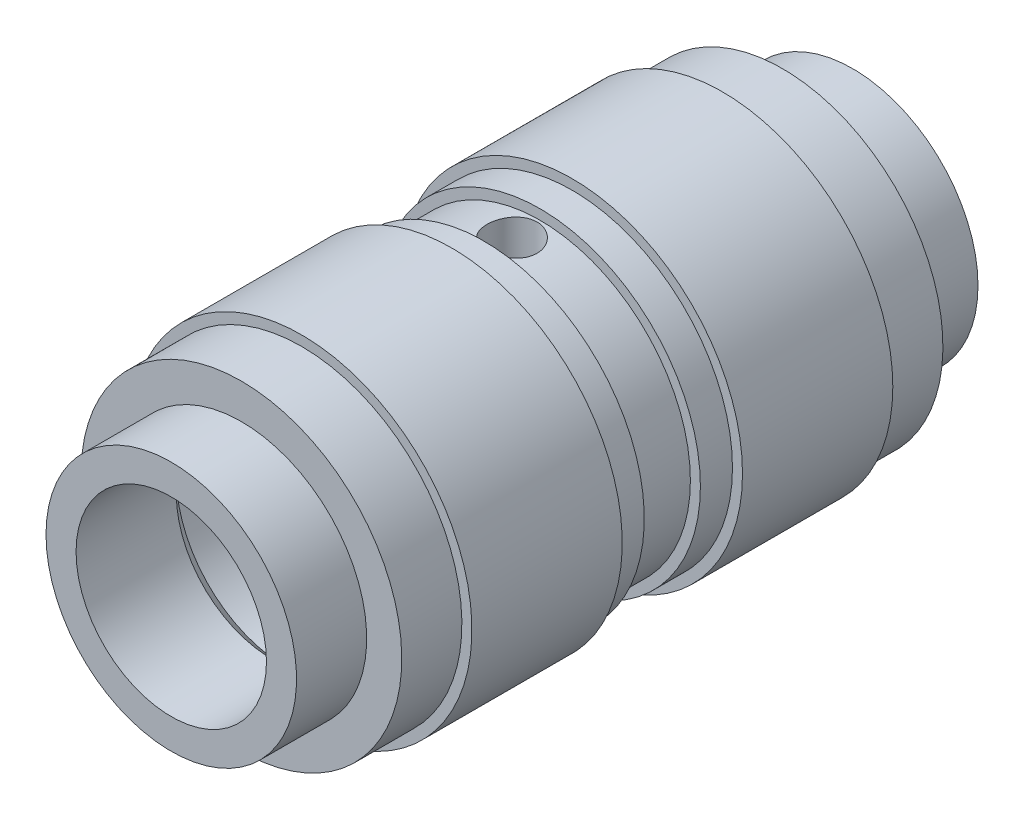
ISO-10303-21;
HEADER;
FILE_DESCRIPTION(('STEP AP214'),'2;1');
FILE_NAME('part.step','',(''),(''),'','','');
FILE_SCHEMA(('AUTOMOTIVE_DESIGN { 1 0 10303 214 1 1 1 1 }'));
ENDSEC;
DATA;
#1=APPLICATION_CONTEXT('core data for automotive mechanical design processes');
#2=APPLICATION_PROTOCOL_DEFINITION('international standard','automotive_design',2000,#1);
#3=PRODUCT_CONTEXT('',#1,'mechanical');
#4=PRODUCT('Part','Part','',(#3));
#5=PRODUCT_RELATED_PRODUCT_CATEGORY('part','',(#4));
#6=PRODUCT_DEFINITION_FORMATION('','',#4);
#7=PRODUCT_DEFINITION_CONTEXT('part definition',#1,'design');
#8=PRODUCT_DEFINITION('design','',#6,#7);
#9=PRODUCT_DEFINITION_SHAPE('','',#8);
#10=(LENGTH_UNIT() NAMED_UNIT(*) SI_UNIT(.MILLI.,.METRE.));
#11=(NAMED_UNIT(*) PLANE_ANGLE_UNIT() SI_UNIT($,.RADIAN.));
#12=(NAMED_UNIT(*) SI_UNIT($,.STERADIAN.) SOLID_ANGLE_UNIT());
#13=UNCERTAINTY_MEASURE_WITH_UNIT(LENGTH_MEASURE(1.E-05),#10,'distance_accuracy_value','');
#14=(GEOMETRIC_REPRESENTATION_CONTEXT(3) GLOBAL_UNCERTAINTY_ASSIGNED_CONTEXT((#13)) GLOBAL_UNIT_ASSIGNED_CONTEXT((#10,
#11,#12)) REPRESENTATION_CONTEXT('',''));
#15=CARTESIAN_POINT('',(0.,0.,0.));
#16=DIRECTION('',(0.,0.,1.));
#17=DIRECTION('',(1.,0.,0.));
#18=AXIS2_PLACEMENT_3D('',#15,#16,#17);
#19=CARTESIAN_POINT('',(0.,0.,-34.));
#20=DIRECTION('',(0.,0.,1.));
#21=DIRECTION('',(1.,0.,0.));
#22=AXIS2_PLACEMENT_3D('',#19,#20,#21);
#23=CYLINDRICAL_SURFACE('',#22,9.5);
#24=CARTESIAN_POINT('',(0.,0.,-34.));
#25=DIRECTION('',(0.,0.,1.));
#26=DIRECTION('',(1.,0.,0.));
#27=AXIS2_PLACEMENT_3D('',#24,#25,#26);
#28=CIRCLE('',#27,9.5);
#29=CARTESIAN_POINT('',(9.5,0.,-34.));
#30=VERTEX_POINT('',#29);
#31=EDGE_CURVE('E107',#30,#30,#28,.F.);
#32=ORIENTED_EDGE('',*,*,#31,.T.);
#33=EDGE_LOOP('',(#32));
#34=FACE_BOUND('',#33,.T.);
#35=CARTESIAN_POINT('',(0.,0.,-24.));
#36=DIRECTION('',(0.,0.,1.));
#37=DIRECTION('',(1.,0.,0.));
#38=AXIS2_PLACEMENT_3D('',#35,#36,#37);
#39=CIRCLE('',#38,9.5);
#40=CARTESIAN_POINT('',(9.5,0.,-24.));
#41=VERTEX_POINT('',#40);
#42=EDGE_CURVE('E48',#41,#41,#39,.F.);
#43=ORIENTED_EDGE('',*,*,#42,.F.);
#44=EDGE_LOOP('',(#43));
#45=FACE_BOUND('',#44,.T.);
#46=ADVANCED_FACE('F28',(#34,#45),#23,.F.);
#47=CARTESIAN_POINT('',(-12.65,-12.65,-34.));
#48=DIRECTION('',(0.,0.,1.));
#49=DIRECTION('',(1.,0.,0.));
#50=AXIS2_PLACEMENT_3D('',#47,#48,#49);
#51=PLANE('',#50);
#52=ORIENTED_EDGE('',*,*,#31,.F.);
#53=EDGE_LOOP('',(#52));
#54=FACE_BOUND('',#53,.T.);
#55=CARTESIAN_POINT('',(0.,0.,-34.));
#56=DIRECTION('',(0.,0.,1.));
#57=DIRECTION('',(1.,0.,0.));
#58=AXIS2_PLACEMENT_3D('',#55,#56,#57);
#59=CIRCLE('',#58,12.5);
#60=CARTESIAN_POINT('',(12.5,0.,-34.));
#61=VERTEX_POINT('',#60);
#62=EDGE_CURVE('E105',#61,#61,#59,.F.);
#63=ORIENTED_EDGE('',*,*,#62,.T.);
#64=EDGE_LOOP('',(#63));
#65=FACE_BOUND('',#64,.T.);
#66=ADVANCED_FACE('F135',(#54,#65),#51,.F.);
#67=CARTESIAN_POINT('',(0.,0.,-24.));
#68=DIRECTION('',(0.,0.,1.));
#69=DIRECTION('',(1.,0.,0.));
#70=AXIS2_PLACEMENT_3D('',#67,#68,#69);
#71=CONICAL_SURFACE('',#70,9.5,0.785398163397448);
#72=ORIENTED_EDGE('',*,*,#42,.T.);
#73=EDGE_LOOP('',(#72));
#74=FACE_BOUND('',#73,.T.);
#75=CARTESIAN_POINT('',(0.,0.,-22.5));
#76=DIRECTION('',(0.,0.,1.));
#77=DIRECTION('',(1.,0.,0.));
#78=AXIS2_PLACEMENT_3D('',#75,#76,#77);
#79=CIRCLE('',#78,11.);
#80=CARTESIAN_POINT('',(11.,0.,-22.5));
#81=VERTEX_POINT('',#80);
#82=EDGE_CURVE('E104',#81,#81,#79,.F.);
#83=ORIENTED_EDGE('',*,*,#82,.F.);
#84=EDGE_LOOP('',(#83));
#85=FACE_BOUND('',#84,.T.);
#86=ADVANCED_FACE('F136',(#74,#85),#71,.F.);
#87=CARTESIAN_POINT('',(0.,0.,-34.));
#88=DIRECTION('',(0.,0.,1.));
#89=DIRECTION('',(1.,0.,0.));
#90=AXIS2_PLACEMENT_3D('',#87,#88,#89);
#91=CYLINDRICAL_SURFACE('',#90,12.5);
#92=CARTESIAN_POINT('',(0.,0.,-27.));
#93=DIRECTION('',(0.,0.,1.));
#94=DIRECTION('',(1.,0.,0.));
#95=AXIS2_PLACEMENT_3D('',#92,#93,#94);
#96=CIRCLE('',#95,12.5);
#97=CARTESIAN_POINT('',(12.5,0.,-27.));
#98=VERTEX_POINT('',#97);
#99=EDGE_CURVE('E101',#98,#98,#96,.F.);
#100=ORIENTED_EDGE('',*,*,#99,.T.);
#101=EDGE_LOOP('',(#100));
#102=FACE_BOUND('',#101,.T.);
#103=ORIENTED_EDGE('',*,*,#62,.F.);
#104=EDGE_LOOP('',(#103));
#105=FACE_BOUND('',#104,.T.);
#106=ADVANCED_FACE('F139',(#102,#105),#91,.T.);
#107=CARTESIAN_POINT('',(0.,0.,-22.5));
#108=DIRECTION('',(0.,0.,1.));
#109=DIRECTION('',(1.,0.,0.));
#110=AXIS2_PLACEMENT_3D('',#107,#108,#109);
#111=CYLINDRICAL_SURFACE('',#110,11.);
#112=ORIENTED_EDGE('',*,*,#82,.T.);
#113=EDGE_LOOP('',(#112));
#114=FACE_BOUND('',#113,.T.);
#115=CARTESIAN_POINT('',(0.,0.,-5.50000000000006));
#116=DIRECTION('',(0.,0.,-1.));
#117=DIRECTION('',(-1.,0.,0.));
#118=AXIS2_PLACEMENT_3D('',#115,#116,#117);
#119=CIRCLE('',#118,11.);
#120=CARTESIAN_POINT('',(-11.,0.,-5.5));
#121=VERTEX_POINT('',#120);
#122=EDGE_CURVE('E100',#121,#121,#119,.T.);
#123=ORIENTED_EDGE('',*,*,#122,.F.);
#124=EDGE_LOOP('',(#123));
#125=FACE_BOUND('',#124,.T.);
#126=ADVANCED_FACE('F143',(#114,#125),#111,.F.);
#127=CARTESIAN_POINT('',(-16.192,-16.192,-27.));
#128=DIRECTION('',(0.,0.,1.));
#129=DIRECTION('',(1.,0.,0.));
#130=AXIS2_PLACEMENT_3D('',#127,#128,#129);
#131=PLANE('',#130);
#132=ORIENTED_EDGE('',*,*,#99,.F.);
#133=EDGE_LOOP('',(#132));
#134=FACE_BOUND('',#133,.T.);
#135=CARTESIAN_POINT('',(0.,0.,-27.));
#136=DIRECTION('',(0.,0.,1.));
#137=DIRECTION('',(0.,-1.,0.));
#138=AXIS2_PLACEMENT_3D('',#135,#136,#137);
#139=CIRCLE('',#138,16.);
#140=CARTESIAN_POINT('',(0.,-16.,-27.));
#141=VERTEX_POINT('',#140);
#142=EDGE_CURVE('E97',#141,#141,#139,.F.);
#143=ORIENTED_EDGE('',*,*,#142,.T.);
#144=EDGE_LOOP('',(#143));
#145=FACE_BOUND('',#144,.T.);
#146=ADVANCED_FACE('F147',(#134,#145),#131,.F.);
#147=CARTESIAN_POINT('',(0.,0.,-4.));
#148=DIRECTION('',(0.,0.,-1.));
#149=DIRECTION('',(-1.,0.,0.));
#150=AXIS2_PLACEMENT_3D('',#147,#148,#149);
#151=CONICAL_SURFACE('',#150,9.5,0.785398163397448);
#152=CARTESIAN_POINT('',(0.,0.,-4.));
#153=DIRECTION('',(0.,0.,1.));
#154=DIRECTION('',(1.,0.,0.));
#155=AXIS2_PLACEMENT_3D('',#152,#153,#154);
#156=CIRCLE('',#155,9.5);
#157=CARTESIAN_POINT('',(9.5,0.,-4.));
#158=VERTEX_POINT('',#157);
#159=EDGE_CURVE('E96',#158,#158,#156,.F.);
#160=ORIENTED_EDGE('',*,*,#159,.F.);
#161=EDGE_LOOP('',(#160));
#162=FACE_BOUND('',#161,.T.);
#163=ORIENTED_EDGE('',*,*,#122,.T.);
#164=EDGE_LOOP('',(#163));
#165=FACE_BOUND('',#164,.T.);
#166=ADVANCED_FACE('F149',(#162,#165),#151,.F.);
#167=CARTESIAN_POINT('',(0.,0.,-27.));
#168=DIRECTION('',(0.,0.,1.));
#169=DIRECTION('',(0.,-1.,0.));
#170=AXIS2_PLACEMENT_3D('',#167,#168,#169);
#171=CYLINDRICAL_SURFACE('',#170,16.);
#172=CARTESIAN_POINT('',(0.,0.,-21.));
#173=DIRECTION('',(0.,0.,1.));
#174=DIRECTION('',(0.,-1.,0.));
#175=AXIS2_PLACEMENT_3D('',#172,#173,#174);
#176=CIRCLE('',#175,16.);
#177=CARTESIAN_POINT('',(0.,-16.,-21.));
#178=VERTEX_POINT('',#177);
#179=EDGE_CURVE('E93',#178,#178,#176,.F.);
#180=ORIENTED_EDGE('',*,*,#179,.T.);
#181=EDGE_LOOP('',(#180));
#182=FACE_BOUND('',#181,.T.);
#183=ORIENTED_EDGE('',*,*,#142,.F.);
#184=EDGE_LOOP('',(#183));
#185=FACE_BOUND('',#184,.T.);
#186=ADVANCED_FACE('F151',(#182,#185),#171,.T.);
#187=CARTESIAN_POINT('',(0.,0.,-4.));
#188=DIRECTION('',(0.,0.,1.));
#189=DIRECTION('',(1.,0.,0.));
#190=AXIS2_PLACEMENT_3D('',#187,#188,#189);
#191=CYLINDRICAL_SURFACE('',#190,9.5);
#192=CARTESIAN_POINT('',(0.,9.5,-2.5));
#193=CARTESIAN_POINT('',(0.137884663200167,9.4999978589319,-2.49999659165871));
#194=CARTESIAN_POINT('',(0.275806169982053,9.49696845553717,-2.48855441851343));
#195=CARTESIAN_POINT('',(0.54768042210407,9.48517762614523,-2.44316636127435));
#196=CARTESIAN_POINT('',(0.681631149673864,9.47641333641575,-2.40920923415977));
#197=CARTESIAN_POINT('',(0.941599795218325,9.45412076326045,-2.31996842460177));
#198=CARTESIAN_POINT('',(1.06762755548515,9.44059853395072,-2.26471183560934));
#199=CARTESIAN_POINT('',(1.30862652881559,9.41022151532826,-2.13453997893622));
#200=CARTESIAN_POINT('',(1.42359708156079,9.39336652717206,-2.05962353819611));
#201=CARTESIAN_POINT('',(1.64181993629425,9.35771941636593,-1.89046838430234));
#202=CARTESIAN_POINT('',(1.74478634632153,9.33889486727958,-1.79586767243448));
#203=CARTESIAN_POINT('',(1.93359084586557,9.30164002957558,-1.59080344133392));
#204=CARTESIAN_POINT('',(2.01942679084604,9.28320979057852,-1.48033793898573));
#205=CARTESIAN_POINT('',(2.17291708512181,9.24849966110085,-1.24441123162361));
#206=CARTESIAN_POINT('',(2.24024449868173,9.23226073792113,-1.11873074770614));
#207=CARTESIAN_POINT('',(2.35270147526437,9.20424780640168,-0.857337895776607));
#208=CARTESIAN_POINT('',(2.39783501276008,9.19247299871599,-0.721627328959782));
#209=CARTESIAN_POINT('',(2.46363395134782,9.17505594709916,-0.447188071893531));
#210=CARTESIAN_POINT('',(2.48481677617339,9.16928424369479,-0.308591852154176));
#211=CARTESIAN_POINT('',(2.50372582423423,9.16413995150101,-0.0297019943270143));
#212=CARTESIAN_POINT('',(2.50145630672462,9.16476620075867,0.110591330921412));
#213=CARTESIAN_POINT('',(2.47393631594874,9.1722310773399,0.384870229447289));
#214=CARTESIAN_POINT('',(2.44930986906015,9.1789010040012,0.518923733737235));
#215=CARTESIAN_POINT('',(2.37877367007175,9.19743185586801,0.780926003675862));
#216=CARTESIAN_POINT('',(2.33286225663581,9.2092931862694,0.908874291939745));
#217=CARTESIAN_POINT('',(2.22054589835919,9.23702010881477,1.15667078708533));
#218=CARTESIAN_POINT('',(2.15392053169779,9.25292841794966,1.27641410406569));
#219=CARTESIAN_POINT('',(2.0022213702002,9.28693362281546,1.50324135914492));
#220=CARTESIAN_POINT('',(1.91714402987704,9.30503093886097,1.61032285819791));
#221=CARTESIAN_POINT('',(1.72775627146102,9.3420790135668,1.81235449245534));
#222=CARTESIAN_POINT('',(1.62292126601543,9.36103863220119,1.90681192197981));
#223=CARTESIAN_POINT('',(1.39866809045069,9.39715951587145,2.07690465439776));
#224=CARTESIAN_POINT('',(1.27924937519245,9.41432071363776,2.15253925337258));
#225=CARTESIAN_POINT('',(1.02846858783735,9.44501219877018,2.28304842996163));
#226=CARTESIAN_POINT('',(0.897059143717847,9.45852716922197,2.33783581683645));
#227=CARTESIAN_POINT('',(0.626458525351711,9.48029259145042,2.42440041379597));
#228=CARTESIAN_POINT('',(0.487269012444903,9.48854416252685,2.45618251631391));
#229=CARTESIAN_POINT('',(0.209265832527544,9.49868456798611,2.49506532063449));
#230=CARTESIAN_POINT('',(0.0705520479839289,9.50074610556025,2.50283612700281));
#231=CARTESIAN_POINT('',(-0.206196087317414,9.49876969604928,2.49532360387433));
#232=CARTESIAN_POINT('',(-0.344230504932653,9.49473236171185,2.48004259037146));
#233=CARTESIAN_POINT('',(-0.613323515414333,9.48112321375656,2.42741045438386));
#234=CARTESIAN_POINT('',(-0.744460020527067,9.47164474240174,2.39043132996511));
#235=CARTESIAN_POINT('',(-0.998656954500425,9.44822690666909,2.29588312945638));
#236=CARTESIAN_POINT('',(-1.12171651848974,9.43428706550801,2.23831185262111));
#237=CARTESIAN_POINT('',(-1.35888360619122,9.40308612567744,2.10295867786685));
#238=CARTESIAN_POINT('',(-1.47277384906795,9.38576639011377,2.02480991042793));
#239=CARTESIAN_POINT('',(-1.68605972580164,9.34980860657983,1.85098296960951));
#240=CARTESIAN_POINT('',(-1.78545256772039,9.33117030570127,1.75530142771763));
#241=CARTESIAN_POINT('',(-1.96973268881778,9.29404354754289,1.54600098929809));
#242=CARTESIAN_POINT('',(-2.05414772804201,9.27557319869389,1.43196233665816));
#243=CARTESIAN_POINT('',(-2.20265077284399,9.24143699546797,1.19094950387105));
#244=CARTESIAN_POINT('',(-2.26673964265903,9.22577102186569,1.06397587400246));
#245=CARTESIAN_POINT('',(-2.37228864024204,9.1991961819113,0.801343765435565));
#246=CARTESIAN_POINT('',(-2.41388084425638,9.18825962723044,0.665741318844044));
#247=CARTESIAN_POINT('',(-2.47357685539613,9.17237100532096,0.389131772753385));
#248=CARTESIAN_POINT('',(-2.49168647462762,9.16741745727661,0.248126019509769));
#249=CARTESIAN_POINT('',(-2.5035754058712,9.16417710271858,-0.0304591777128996));
#250=CARTESIAN_POINT('',(-2.49811278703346,9.16568256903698,-0.16800434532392));
#251=CARTESIAN_POINT('',(-2.46476570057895,9.17470557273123,-0.440138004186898));
#252=CARTESIAN_POINT('',(-2.43688178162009,9.18222296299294,-0.574726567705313));
#253=CARTESIAN_POINT('',(-2.35991776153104,9.20230081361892,-0.83620045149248));
#254=CARTESIAN_POINT('',(-2.31099432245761,9.214823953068,-0.963134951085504));
#255=CARTESIAN_POINT('',(-2.19346205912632,9.24350405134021,-1.20708916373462));
#256=CARTESIAN_POINT('',(-2.12485022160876,9.25966156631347,-1.32410735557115));
#257=CARTESIAN_POINT('',(-1.96757430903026,9.29436941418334,-1.54853541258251));
#258=CARTESIAN_POINT('',(-1.87839103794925,9.31297513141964,-1.6555729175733));
#259=CARTESIAN_POINT('',(-1.68349652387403,9.35016921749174,-1.85340941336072));
#260=CARTESIAN_POINT('',(-1.57778128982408,9.36875758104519,-1.94420447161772));
#261=CARTESIAN_POINT('',(-1.35018708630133,9.40428175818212,-2.10882024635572));
#262=CARTESIAN_POINT('',(-1.22801920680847,9.42117547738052,-2.18225135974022));
#263=CARTESIAN_POINT('',(-0.972633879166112,9.45095016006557,-2.30741745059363));
#264=CARTESIAN_POINT('',(-0.839423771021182,9.46383376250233,-2.35916670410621));
#265=CARTESIAN_POINT('',(-0.588875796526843,9.48241870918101,-2.43254809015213));
#266=CARTESIAN_POINT('',(-0.472643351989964,9.4889642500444,-2.4577847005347));
#267=CARTESIAN_POINT('',(-0.237616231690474,9.49775561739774,-2.49151134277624));
#268=CARTESIAN_POINT('',(-0.118821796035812,9.50000184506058,-2.50000293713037));
#269=CARTESIAN_POINT('',(0.,9.5,-2.5));
#270=B_SPLINE_CURVE_WITH_KNOTS('',3,(#192,#193,#194,#195,#196,#197,#198,#199,#200,#201,#202,
#203,#204,#205,#206,#207,#208,#209,#210,#211,#212,#213,#214,#215,#216,#217,#218,#219,#220,#221,
#222,#223,#224,#225,#226,#227,#228,#229,#230,#231,#232,#233,#234,#235,#236,#237,#238,#239,#240,
#241,#242,#243,#244,#245,#246,#247,#248,#249,#250,#251,#252,#253,#254,#255,#256,#257,#258,#259,
#260,#261,#262,#263,#264,#265,#266,#267,#268,#269),.UNSPECIFIED.,.T.,.F.,(4,2,2,2,2,2,2,2,2,2,2,
2,2,2,2,2,2,2,2,2,2,2,2,2,2,2,2,2,2,2,2,2,2,2,2,2,2,2,4),(0.,0.413218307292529,
0.826643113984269,1.23954376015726,1.65246904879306,2.07379267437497,2.49516901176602,
2.92356960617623,3.35189345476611,3.77077570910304,4.18958189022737,4.59704611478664,
5.00454214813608,5.41653210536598,5.82860129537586,6.2537447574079,6.67890411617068,
7.10582259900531,7.53265026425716,7.94745325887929,8.36221458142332,8.7700647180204,
9.177958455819,9.59368485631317,10.0094912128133,10.4366941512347,10.8638789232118,
11.2885277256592,11.7130714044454,12.1240655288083,12.5350495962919,12.9430250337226,
13.3510629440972,13.7708169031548,14.1906723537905,14.6192052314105,15.0474555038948,
15.4035786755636,15.7596686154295),.UNSPECIFIED.);
#271=CARTESIAN_POINT('',(0.,9.5,-2.5));
#272=VERTEX_POINT('',#271);
#273=EDGE_CURVE('E109',#272,#272,#270,.T.);
#274=ORIENTED_EDGE('',*,*,#273,.F.);
#275=EDGE_LOOP('',(#274));
#276=FACE_BOUND('',#275,.T.);
#277=ORIENTED_EDGE('',*,*,#159,.T.);
#278=EDGE_LOOP('',(#277));
#279=FACE_BOUND('',#278,.T.);
#280=CARTESIAN_POINT('',(0.,0.,4.));
#281=DIRECTION('',(0.,0.,1.));
#282=DIRECTION('',(-1.,0.,0.));
#283=AXIS2_PLACEMENT_3D('',#280,#281,#282);
#284=CIRCLE('',#283,9.5);
#285=CARTESIAN_POINT('',(-9.5,0.,4.));
#286=VERTEX_POINT('',#285);
#287=EDGE_CURVE('E92',#286,#286,#284,.F.);
#288=ORIENTED_EDGE('',*,*,#287,.F.);
#289=EDGE_LOOP('',(#288));
#290=FACE_BOUND('',#289,.T.);
#291=ADVANCED_FACE('F123',(#276,#279,#290),#191,.F.);
#292=CARTESIAN_POINT('',(-17.204,-17.204,-21.));
#293=DIRECTION('',(0.,0.,1.));
#294=DIRECTION('',(1.,0.,0.));
#295=AXIS2_PLACEMENT_3D('',#292,#293,#294);
#296=PLANE('',#295);
#297=ORIENTED_EDGE('',*,*,#179,.F.);
#298=EDGE_LOOP('',(#297));
#299=FACE_BOUND('',#298,.T.);
#300=CARTESIAN_POINT('',(0.,0.,-21.));
#301=DIRECTION('',(0.,0.,1.));
#302=DIRECTION('',(1.,0.,0.));
#303=AXIS2_PLACEMENT_3D('',#300,#301,#302);
#304=CIRCLE('',#303,17.);
#305=CARTESIAN_POINT('',(17.,0.,-21.));
#306=VERTEX_POINT('',#305);
#307=EDGE_CURVE('E89',#306,#306,#304,.F.);
#308=ORIENTED_EDGE('',*,*,#307,.T.);
#309=EDGE_LOOP('',(#308));
#310=FACE_BOUND('',#309,.T.);
#311=ADVANCED_FACE('F158',(#299,#310),#296,.F.);
#312=CARTESIAN_POINT('',(0.,0.,4.));
#313=DIRECTION('',(0.,0.,1.));
#314=DIRECTION('',(1.,0.,0.));
#315=AXIS2_PLACEMENT_3D('',#312,#313,#314);
#316=CONICAL_SURFACE('',#315,9.5,0.785398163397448);
#317=CARTESIAN_POINT('',(0.,0.,5.5));
#318=DIRECTION('',(0.,0.,-1.));
#319=DIRECTION('',(1.,0.,0.));
#320=AXIS2_PLACEMENT_3D('',#317,#318,#319);
#321=CIRCLE('',#320,11.);
#322=CARTESIAN_POINT('',(11.,0.,5.5));
#323=VERTEX_POINT('',#322);
#324=EDGE_CURVE('E88',#323,#323,#321,.T.);
#325=ORIENTED_EDGE('',*,*,#324,.F.);
#326=EDGE_LOOP('',(#325));
#327=FACE_BOUND('',#326,.T.);
#328=ORIENTED_EDGE('',*,*,#287,.T.);
#329=EDGE_LOOP('',(#328));
#330=FACE_BOUND('',#329,.T.);
#331=ADVANCED_FACE('F183',(#327,#330),#316,.F.);
#332=CARTESIAN_POINT('',(0.,0.,-21.));
#333=DIRECTION('',(0.,0.,1.));
#334=DIRECTION('',(1.,0.,0.));
#335=AXIS2_PLACEMENT_3D('',#332,#333,#334);
#336=CYLINDRICAL_SURFACE('',#335,17.);
#337=CARTESIAN_POINT('',(0.,0.,-6.));
#338=DIRECTION('',(0.,0.,1.));
#339=DIRECTION('',(1.,0.,0.));
#340=AXIS2_PLACEMENT_3D('',#337,#338,#339);
#341=CIRCLE('',#340,17.);
#342=CARTESIAN_POINT('',(17.,0.,-6.));
#343=VERTEX_POINT('',#342);
#344=EDGE_CURVE('E85',#343,#343,#341,.F.);
#345=ORIENTED_EDGE('',*,*,#344,.T.);
#346=EDGE_LOOP('',(#345));
#347=FACE_BOUND('',#346,.T.);
#348=ORIENTED_EDGE('',*,*,#307,.F.);
#349=EDGE_LOOP('',(#348));
#350=FACE_BOUND('',#349,.T.);
#351=ADVANCED_FACE('F244',(#347,#350),#336,.T.);
#352=CARTESIAN_POINT('',(0.,0.,22.5));
#353=DIRECTION('',(0.,0.,-1.));
#354=DIRECTION('',(-1.,0.,0.));
#355=AXIS2_PLACEMENT_3D('',#352,#353,#354);
#356=CYLINDRICAL_SURFACE('',#355,11.);
#357=ORIENTED_EDGE('',*,*,#324,.T.);
#358=EDGE_LOOP('',(#357));
#359=FACE_BOUND('',#358,.T.);
#360=CARTESIAN_POINT('',(0.,0.,22.5));
#361=DIRECTION('',(0.,0.,-1.));
#362=DIRECTION('',(1.,0.,0.));
#363=AXIS2_PLACEMENT_3D('',#360,#361,#362);
#364=CIRCLE('',#363,11.);
#365=CARTESIAN_POINT('',(11.,0.,22.5));
#366=VERTEX_POINT('',#365);
#367=EDGE_CURVE('E84',#366,#366,#364,.T.);
#368=ORIENTED_EDGE('',*,*,#367,.F.);
#369=EDGE_LOOP('',(#368));
#370=FACE_BOUND('',#369,.T.);
#371=ADVANCED_FACE('F189',(#359,#370),#356,.F.);
#372=CARTESIAN_POINT('',(17.204,-17.204,-6.));
#373=DIRECTION('',(0.,0.,-1.));
#374=DIRECTION('',(-1.,0.,0.));
#375=AXIS2_PLACEMENT_3D('',#372,#373,#374);
#376=PLANE('',#375);
#377=CARTESIAN_POINT('',(0.,0.,-6.));
#378=DIRECTION('',(0.,0.,1.));
#379=DIRECTION('',(1.,0.,0.));
#380=AXIS2_PLACEMENT_3D('',#377,#378,#379);
#381=CIRCLE('',#380,16.);
#382=CARTESIAN_POINT('',(16.,0.,-6.));
#383=VERTEX_POINT('',#382);
#384=EDGE_CURVE('E81',#383,#383,#381,.F.);
#385=ORIENTED_EDGE('',*,*,#384,.T.);
#386=EDGE_LOOP('',(#385));
#387=FACE_BOUND('',#386,.T.);
#388=ORIENTED_EDGE('',*,*,#344,.F.);
#389=EDGE_LOOP('',(#388));
#390=FACE_BOUND('',#389,.T.);
#391=ADVANCED_FACE('F185',(#387,#390),#376,.F.);
#392=CARTESIAN_POINT('',(0.,0.,24.));
#393=DIRECTION('',(0.,0.,-1.));
#394=DIRECTION('',(-1.,0.,0.));
#395=AXIS2_PLACEMENT_3D('',#392,#393,#394);
#396=CONICAL_SURFACE('',#395,9.5,0.785398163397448);
#397=ORIENTED_EDGE('',*,*,#367,.T.);
#398=EDGE_LOOP('',(#397));
#399=FACE_BOUND('',#398,.T.);
#400=CARTESIAN_POINT('',(0.,0.,24.));
#401=DIRECTION('',(0.,0.,-1.));
#402=DIRECTION('',(1.,0.,0.));
#403=AXIS2_PLACEMENT_3D('',#400,#401,#402);
#404=CIRCLE('',#403,9.5);
#405=CARTESIAN_POINT('',(9.5,0.,24.));
#406=VERTEX_POINT('',#405);
#407=EDGE_CURVE('E80',#406,#406,#404,.T.);
#408=ORIENTED_EDGE('',*,*,#407,.F.);
#409=EDGE_LOOP('',(#408));
#410=FACE_BOUND('',#409,.T.);
#411=ADVANCED_FACE('F188',(#399,#410),#396,.F.);
#412=CARTESIAN_POINT('',(0.,0.,-6.));
#413=DIRECTION('',(0.,0.,1.));
#414=DIRECTION('',(1.,0.,0.));
#415=AXIS2_PLACEMENT_3D('',#412,#413,#414);
#416=CYLINDRICAL_SURFACE('',#415,16.);
#417=ORIENTED_EDGE('',*,*,#384,.F.);
#418=EDGE_LOOP('',(#417));
#419=FACE_BOUND('',#418,.T.);
#420=CARTESIAN_POINT('',(0.,0.,-2.8));
#421=DIRECTION('',(0.,0.,1.));
#422=DIRECTION('',(1.,0.,0.));
#423=AXIS2_PLACEMENT_3D('',#420,#421,#422);
#424=CIRCLE('',#423,16.);
#425=CARTESIAN_POINT('',(16.,0.,-2.8));
#426=VERTEX_POINT('',#425);
#427=EDGE_CURVE('E77',#426,#426,#424,.T.);
#428=ORIENTED_EDGE('',*,*,#427,.F.);
#429=EDGE_LOOP('',(#428));
#430=FACE_BOUND('',#429,.T.);
#431=ADVANCED_FACE('F234',(#419,#430),#416,.T.);
#432=CARTESIAN_POINT('',(0.,0.,34.));
#433=DIRECTION('',(0.,0.,-1.));
#434=DIRECTION('',(-1.,0.,0.));
#435=AXIS2_PLACEMENT_3D('',#432,#433,#434);
#436=CYLINDRICAL_SURFACE('',#435,9.5);
#437=ORIENTED_EDGE('',*,*,#407,.T.);
#438=EDGE_LOOP('',(#437));
#439=FACE_BOUND('',#438,.T.);
#440=CARTESIAN_POINT('',(0.,0.,34.));
#441=DIRECTION('',(0.,0.,-1.));
#442=DIRECTION('',(-1.,0.,0.));
#443=AXIS2_PLACEMENT_3D('',#440,#441,#442);
#444=CIRCLE('',#443,9.5);
#445=CARTESIAN_POINT('',(-9.5,0.,34.));
#446=VERTEX_POINT('',#445);
#447=EDGE_CURVE('E74',#446,#446,#444,.F.);
#448=ORIENTED_EDGE('',*,*,#447,.T.);
#449=EDGE_LOOP('',(#448));
#450=FACE_BOUND('',#449,.T.);
#451=ADVANCED_FACE('F195',(#439,#450),#436,.F.);
#452=CARTESIAN_POINT('',(-16.192,-16.192,-2.8));
#453=DIRECTION('',(0.,0.,1.));
#454=DIRECTION('',(1.,0.,0.));
#455=AXIS2_PLACEMENT_3D('',#452,#453,#454);
#456=PLANE('',#455);
#457=CARTESIAN_POINT('',(0.,0.,-2.8));
#458=DIRECTION('',(0.,0.,1.));
#459=DIRECTION('',(1.,0.,0.));
#460=AXIS2_PLACEMENT_3D('',#457,#458,#459);
#461=CIRCLE('',#460,15.);
#462=CARTESIAN_POINT('',(15.,0.,-2.8));
#463=VERTEX_POINT('',#462);
#464=EDGE_CURVE('E71',#463,#463,#461,.F.);
#465=ORIENTED_EDGE('',*,*,#464,.T.);
#466=EDGE_LOOP('',(#465));
#467=FACE_BOUND('',#466,.T.);
#468=ORIENTED_EDGE('',*,*,#427,.T.);
#469=EDGE_LOOP('',(#468));
#470=FACE_BOUND('',#469,.T.);
#471=ADVANCED_FACE('F191',(#467,#470),#456,.T.);
#472=CARTESIAN_POINT('',(-12.65,12.65,34.));
#473=DIRECTION('',(0.,0.,-1.));
#474=DIRECTION('',(1.,0.,0.));
#475=AXIS2_PLACEMENT_3D('',#472,#473,#474);
#476=PLANE('',#475);
#477=ORIENTED_EDGE('',*,*,#447,.F.);
#478=EDGE_LOOP('',(#477));
#479=FACE_BOUND('',#478,.T.);
#480=CARTESIAN_POINT('',(0.,0.,34.));
#481=DIRECTION('',(0.,0.,-1.));
#482=DIRECTION('',(-1.,0.,0.));
#483=AXIS2_PLACEMENT_3D('',#480,#481,#482);
#484=CIRCLE('',#483,12.5);
#485=CARTESIAN_POINT('',(-12.5,0.,34.));
#486=VERTEX_POINT('',#485);
#487=EDGE_CURVE('E68',#486,#486,#484,.F.);
#488=ORIENTED_EDGE('',*,*,#487,.T.);
#489=EDGE_LOOP('',(#488));
#490=FACE_BOUND('',#489,.T.);
#491=ADVANCED_FACE('F194',(#479,#490),#476,.F.);
#492=CARTESIAN_POINT('',(0.,0.,-2.8));
#493=DIRECTION('',(0.,0.,1.));
#494=DIRECTION('',(1.,0.,0.));
#495=AXIS2_PLACEMENT_3D('',#492,#493,#494);
#496=CYLINDRICAL_SURFACE('',#495,15.);
#497=CARTESIAN_POINT('',(0.,15.,-2.5));
#498=CARTESIAN_POINT('',(0.139390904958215,14.9999976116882,-2.49999441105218));
#499=CARTESIAN_POINT('',(0.27885788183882,14.9980367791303,-2.48830272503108));
#500=CARTESIAN_POINT('',(0.553880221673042,14.9904034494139,-2.44186434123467));
#501=CARTESIAN_POINT('',(0.689431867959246,14.9847275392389,-2.40709644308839));
#502=CARTESIAN_POINT('',(0.952604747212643,14.9703006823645,-2.31558455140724));
#503=CARTESIAN_POINT('',(1.0802323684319,14.9615522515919,-2.25885853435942));
#504=CARTESIAN_POINT('',(1.32414184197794,14.9419422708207,-2.1250877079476));
#505=CARTESIAN_POINT('',(1.44042498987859,14.9310809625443,-2.048045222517));
#506=CARTESIAN_POINT('',(1.65947261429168,14.9083331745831,-1.87504491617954));
#507=CARTESIAN_POINT('',(1.76211290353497,14.8964387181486,-1.77893088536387));
#508=CARTESIAN_POINT('',(1.94988849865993,14.8730262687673,-1.57085203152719));
#509=CARTESIAN_POINT('',(2.03502269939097,14.8615082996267,-1.45888620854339));
#510=CARTESIAN_POINT('',(2.18586712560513,14.8400756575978,-1.22142903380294));
#511=CARTESIAN_POINT('',(2.251454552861,14.8301712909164,-1.09585866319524));
#512=CARTESIAN_POINT('',(2.36055836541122,14.8131978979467,-0.835290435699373));
#513=CARTESIAN_POINT('',(2.40407624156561,14.8061286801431,-0.700293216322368));
#514=CARTESIAN_POINT('',(2.4674143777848,14.7957053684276,-0.42601972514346));
#515=CARTESIAN_POINT('',(2.4874490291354,14.792317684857,-0.286794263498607));
#516=CARTESIAN_POINT('',(2.50391672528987,14.7895393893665,-0.00691972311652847));
#517=CARTESIAN_POINT('',(2.50035144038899,14.7901484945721,0.133729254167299));
#518=CARTESIAN_POINT('',(2.46989509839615,14.7952642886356,0.410927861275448));
#519=CARTESIAN_POINT('',(2.44324488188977,14.7997307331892,0.547504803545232));
#520=CARTESIAN_POINT('',(2.36775314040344,14.8119949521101,0.814221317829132));
#521=CARTESIAN_POINT('',(2.31891085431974,14.8197928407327,0.944360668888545));
#522=CARTESIAN_POINT('',(2.20017724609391,14.837884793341,1.19522882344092));
#523=CARTESIAN_POINT('',(2.13018591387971,14.8481906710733,1.31590940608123));
#524=CARTESIAN_POINT('',(1.97121201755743,14.8701291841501,1.54390440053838));
#525=CARTESIAN_POINT('',(1.88222792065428,14.8817619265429,1.65121773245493));
#526=CARTESIAN_POINT('',(1.68648221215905,14.9052202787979,1.85082608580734));
#527=CARTESIAN_POINT('',(1.57951396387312,14.9170464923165,1.94291851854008));
#528=CARTESIAN_POINT('',(1.35153524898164,14.9394260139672,2.10787776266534));
#529=CARTESIAN_POINT('',(1.23052469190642,14.9499793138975,2.18074445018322));
#530=CARTESIAN_POINT('',(0.97770591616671,14.9686389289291,2.30520222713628));
#531=CARTESIAN_POINT('',(0.84588872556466,14.9767431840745,2.35677541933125));
#532=CARTESIAN_POINT('',(0.575298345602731,14.9895750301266,2.43699421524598));
#533=CARTESIAN_POINT('',(0.436525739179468,14.9943029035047,2.46564173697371));
#534=CARTESIAN_POINT('',(0.157709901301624,14.9998112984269,2.49892135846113));
#535=CARTESIAN_POINT('',(0.0177007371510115,15.0006375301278,2.5038315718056));
#536=CARTESIAN_POINT('',(-0.261139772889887,14.9983747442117,2.49023865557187));
#537=CARTESIAN_POINT('',(-0.399971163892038,14.9952858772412,2.47173642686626));
#538=CARTESIAN_POINT('',(-0.671656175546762,14.985568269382,2.41207515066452));
#539=CARTESIAN_POINT('',(-0.804540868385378,14.9789610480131,2.37105379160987));
#540=CARTESIAN_POINT('',(-1.06154688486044,14.9629446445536,2.26766548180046));
#541=CARTESIAN_POINT('',(-1.18566771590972,14.9535353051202,2.20529733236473));
#542=CARTESIAN_POINT('',(-1.42283068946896,14.9328451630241,2.06034887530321));
#543=CARTESIAN_POINT('',(-1.53576525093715,14.9215485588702,1.97759484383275));
#544=CARTESIAN_POINT('',(-1.74624358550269,14.898384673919,1.79446268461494));
#545=CARTESIAN_POINT('',(-1.84378623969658,14.8865173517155,1.69408327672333));
#546=CARTESIAN_POINT('',(-2.021742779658,14.8634017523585,1.47730245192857));
#547=CARTESIAN_POINT('',(-2.10196876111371,14.8521611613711,1.36074583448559));
#548=CARTESIAN_POINT('',(-2.24170231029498,14.8317152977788,1.11564703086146));
#549=CARTESIAN_POINT('',(-2.30121053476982,14.8225099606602,0.987105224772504));
#550=CARTESIAN_POINT('',(-2.39753833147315,14.807234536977,0.722210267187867));
#551=CARTESIAN_POINT('',(-2.43445143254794,14.8011515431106,0.585891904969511));
#552=CARTESIAN_POINT('',(-2.48483545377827,14.7927771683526,0.308879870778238));
#553=CARTESIAN_POINT('',(-2.49830841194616,14.7904854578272,0.168186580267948));
#554=CARTESIAN_POINT('',(-2.50137286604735,14.7899673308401,-0.111705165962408));
#555=CARTESIAN_POINT('',(-2.49126013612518,14.7916905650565,-0.250900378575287));
#556=CARTESIAN_POINT('',(-2.44807983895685,14.7988978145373,-0.525579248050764));
#557=CARTESIAN_POINT('',(-2.41501234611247,14.8043818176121,-0.661062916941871));
#558=CARTESIAN_POINT('',(-2.3269744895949,14.8184735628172,-0.924358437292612));
#559=CARTESIAN_POINT('',(-2.27202959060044,14.8270776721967,-1.05217901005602));
#560=CARTESIAN_POINT('',(-2.14182700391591,14.8464436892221,-1.29683566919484));
#561=CARTESIAN_POINT('',(-2.06656830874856,14.857205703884,-1.41367121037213));
#562=CARTESIAN_POINT('',(-1.89681888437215,14.8798345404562,-1.63453558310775));
#563=CARTESIAN_POINT('',(-1.80211056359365,14.891712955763,-1.73839601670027));
#564=CARTESIAN_POINT('',(-1.59660903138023,14.9151437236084,-1.92885160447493));
#565=CARTESIAN_POINT('',(-1.48581211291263,14.9266960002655,-2.01544276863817));
#566=CARTESIAN_POINT('',(-1.25036916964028,14.9482652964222,-2.16944826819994));
#567=CARTESIAN_POINT('',(-1.12563278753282,14.958271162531,-2.23672603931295));
#568=CARTESIAN_POINT('',(-0.86651306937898,14.9755116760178,-2.34926948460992));
#569=CARTESIAN_POINT('',(-0.732139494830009,14.9827490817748,-2.39455708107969));
#570=CARTESIAN_POINT('',(-0.4977033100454,14.9920579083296,-2.45200527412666));
#571=CARTESIAN_POINT('',(-0.399058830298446,14.9950202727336,-2.46997446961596));
#572=CARTESIAN_POINT('',(-0.200289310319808,14.9989921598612,-2.49397373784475));
#573=CARTESIAN_POINT('',(-0.100164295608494,15.0000017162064,-2.50000401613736));
#574=CARTESIAN_POINT('',(0.,15.,-2.5));
#575=B_SPLINE_CURVE_WITH_KNOTS('',3,(#497,#498,#499,#500,#501,#502,#503,#504,#505,#506,#507,
#508,#509,#510,#511,#512,#513,#514,#515,#516,#517,#518,#519,#520,#521,#522,#523,#524,#525,#526,
#527,#528,#529,#530,#531,#532,#533,#534,#535,#536,#537,#538,#539,#540,#541,#542,#543,#544,#545,
#546,#547,#548,#549,#550,#551,#552,#553,#554,#555,#556,#557,#558,#559,#560,#561,#562,#563,#564,
#565,#566,#567,#568,#569,#570,#571,#572,#573,#574),.UNSPECIFIED.,.T.,.F.,(4,2,2,2,2,2,2,2,2,2,2,
2,2,2,2,2,2,2,2,2,2,2,2,2,2,2,2,2,2,2,2,2,2,2,2,2,2,2,4),(0.,0.417806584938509,
0.835997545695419,1.25384686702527,1.67164841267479,2.09302491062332,2.51442800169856,
2.9384252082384,3.36239376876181,3.78246077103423,4.20249804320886,4.61820521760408,
5.0339266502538,5.45164556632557,5.86939820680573,6.29232769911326,6.71525991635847,
7.13854688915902,7.56179844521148,7.98007883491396,8.39834313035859,8.81407807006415,
9.22983635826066,9.64926825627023,10.0687306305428,10.4925382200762,10.9163323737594,
11.3383602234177,11.7603513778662,12.177079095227,12.5938054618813,13.0100481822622,
13.4263115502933,13.8475138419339,14.2688133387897,14.693022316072,15.1168075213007,
15.4170424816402,15.7172722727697),.UNSPECIFIED.);
#576=CARTESIAN_POINT('',(0.,15.,-2.5));
#577=VERTEX_POINT('',#576);
#578=EDGE_CURVE('E32',#577,#577,#575,.T.);
#579=ORIENTED_EDGE('',*,*,#578,.T.);
#580=EDGE_LOOP('',(#579));
#581=FACE_BOUND('',#580,.T.);
#582=ORIENTED_EDGE('',*,*,#464,.F.);
#583=EDGE_LOOP('',(#582));
#584=FACE_BOUND('',#583,.T.);
#585=CARTESIAN_POINT('',(0.,0.,2.8));
#586=DIRECTION('',(0.,0.,1.));
#587=DIRECTION('',(1.,0.,0.));
#588=AXIS2_PLACEMENT_3D('',#585,#586,#587);
#589=CIRCLE('',#588,15.);
#590=CARTESIAN_POINT('',(15.,0.,2.8));
#591=VERTEX_POINT('',#590);
#592=EDGE_CURVE('E65',#591,#591,#589,.T.);
#593=ORIENTED_EDGE('',*,*,#592,.F.);
#594=EDGE_LOOP('',(#593));
#595=FACE_BOUND('',#594,.T.);
#596=ADVANCED_FACE('F199',(#581,#584,#595),#496,.T.);
#597=CARTESIAN_POINT('',(0.,0.,34.));
#598=DIRECTION('',(0.,0.,-1.));
#599=DIRECTION('',(-1.,0.,0.));
#600=AXIS2_PLACEMENT_3D('',#597,#598,#599);
#601=CYLINDRICAL_SURFACE('',#600,12.5);
#602=ORIENTED_EDGE('',*,*,#487,.F.);
#603=EDGE_LOOP('',(#602));
#604=FACE_BOUND('',#603,.T.);
#605=CARTESIAN_POINT('',(0.,0.,27.));
#606=DIRECTION('',(0.,0.,-1.));
#607=DIRECTION('',(-1.,0.,0.));
#608=AXIS2_PLACEMENT_3D('',#605,#606,#607);
#609=CIRCLE('',#608,12.5);
#610=CARTESIAN_POINT('',(-12.5,0.,27.));
#611=VERTEX_POINT('',#610);
#612=EDGE_CURVE('E62',#611,#611,#609,.F.);
#613=ORIENTED_EDGE('',*,*,#612,.T.);
#614=EDGE_LOOP('',(#613));
#615=FACE_BOUND('',#614,.T.);
#616=ADVANCED_FACE('F205',(#604,#615),#601,.T.);
#617=CARTESIAN_POINT('',(-16.192,16.192,2.8));
#618=DIRECTION('',(0.,0.,-1.));
#619=DIRECTION('',(1.,0.,0.));
#620=AXIS2_PLACEMENT_3D('',#617,#618,#619);
#621=PLANE('',#620);
#622=ORIENTED_EDGE('',*,*,#592,.T.);
#623=EDGE_LOOP('',(#622));
#624=FACE_BOUND('',#623,.T.);
#625=CARTESIAN_POINT('',(0.,0.,2.8));
#626=DIRECTION('',(0.,0.,-1.));
#627=DIRECTION('',(-1.,0.,0.));
#628=AXIS2_PLACEMENT_3D('',#625,#626,#627);
#629=CIRCLE('',#628,16.);
#630=CARTESIAN_POINT('',(-16.,0.,2.8));
#631=VERTEX_POINT('',#630);
#632=EDGE_CURVE('E59',#631,#631,#629,.T.);
#633=ORIENTED_EDGE('',*,*,#632,.T.);
#634=EDGE_LOOP('',(#633));
#635=FACE_BOUND('',#634,.T.);
#636=ADVANCED_FACE('F201',(#624,#635),#621,.T.);
#637=CARTESIAN_POINT('',(-16.192,16.192,27.));
#638=DIRECTION('',(0.,0.,-1.));
#639=DIRECTION('',(1.,0.,0.));
#640=AXIS2_PLACEMENT_3D('',#637,#638,#639);
#641=PLANE('',#640);
#642=ORIENTED_EDGE('',*,*,#612,.F.);
#643=EDGE_LOOP('',(#642));
#644=FACE_BOUND('',#643,.T.);
#645=CARTESIAN_POINT('',(0.,0.,27.));
#646=DIRECTION('',(0.,0.,-1.));
#647=DIRECTION('',(0.,1.,0.));
#648=AXIS2_PLACEMENT_3D('',#645,#646,#647);
#649=CIRCLE('',#648,16.);
#650=CARTESIAN_POINT('',(0.,16.,27.));
#651=VERTEX_POINT('',#650);
#652=EDGE_CURVE('E56',#651,#651,#649,.F.);
#653=ORIENTED_EDGE('',*,*,#652,.T.);
#654=EDGE_LOOP('',(#653));
#655=FACE_BOUND('',#654,.T.);
#656=ADVANCED_FACE('F204',(#644,#655),#641,.F.);
#657=CARTESIAN_POINT('',(0.,0.,6.));
#658=DIRECTION('',(0.,0.,-1.));
#659=DIRECTION('',(-1.,0.,0.));
#660=AXIS2_PLACEMENT_3D('',#657,#658,#659);
#661=CYLINDRICAL_SURFACE('',#660,16.);
#662=CARTESIAN_POINT('',(0.,0.,6.));
#663=DIRECTION('',(0.,0.,-1.));
#664=DIRECTION('',(-1.,0.,0.));
#665=AXIS2_PLACEMENT_3D('',#662,#663,#664);
#666=CIRCLE('',#665,16.);
#667=CARTESIAN_POINT('',(-16.,0.,6.));
#668=VERTEX_POINT('',#667);
#669=EDGE_CURVE('E53',#668,#668,#666,.T.);
#670=ORIENTED_EDGE('',*,*,#669,.T.);
#671=EDGE_LOOP('',(#670));
#672=FACE_BOUND('',#671,.T.);
#673=ORIENTED_EDGE('',*,*,#632,.F.);
#674=EDGE_LOOP('',(#673));
#675=FACE_BOUND('',#674,.T.);
#676=ADVANCED_FACE('F208',(#672,#675),#661,.T.);
#677=CARTESIAN_POINT('',(0.,0.,27.));
#678=DIRECTION('',(0.,0.,-1.));
#679=DIRECTION('',(0.,1.,0.));
#680=AXIS2_PLACEMENT_3D('',#677,#678,#679);
#681=CYLINDRICAL_SURFACE('',#680,16.);
#682=ORIENTED_EDGE('',*,*,#652,.F.);
#683=EDGE_LOOP('',(#682));
#684=FACE_BOUND('',#683,.T.);
#685=CARTESIAN_POINT('',(0.,0.,21.));
#686=DIRECTION('',(0.,0.,-1.));
#687=DIRECTION('',(0.,1.,0.));
#688=AXIS2_PLACEMENT_3D('',#685,#686,#687);
#689=CIRCLE('',#688,16.);
#690=CARTESIAN_POINT('',(0.,16.,21.));
#691=VERTEX_POINT('',#690);
#692=EDGE_CURVE('E45',#691,#691,#689,.F.);
#693=ORIENTED_EDGE('',*,*,#692,.T.);
#694=EDGE_LOOP('',(#693));
#695=FACE_BOUND('',#694,.T.);
#696=ADVANCED_FACE('F173',(#684,#695),#681,.T.);
#697=CARTESIAN_POINT('',(17.204,17.204,6.));
#698=DIRECTION('',(0.,0.,1.));
#699=DIRECTION('',(-1.,0.,0.));
#700=AXIS2_PLACEMENT_3D('',#697,#698,#699);
#701=PLANE('',#700);
#702=ORIENTED_EDGE('',*,*,#669,.F.);
#703=EDGE_LOOP('',(#702));
#704=FACE_BOUND('',#703,.T.);
#705=CARTESIAN_POINT('',(0.,0.,6.));
#706=DIRECTION('',(0.,0.,-1.));
#707=DIRECTION('',(-1.,0.,0.));
#708=AXIS2_PLACEMENT_3D('',#705,#706,#707);
#709=CIRCLE('',#708,17.);
#710=CARTESIAN_POINT('',(-17.,0.,6.));
#711=VERTEX_POINT('',#710);
#712=EDGE_CURVE('E40',#711,#711,#709,.T.);
#713=ORIENTED_EDGE('',*,*,#712,.T.);
#714=EDGE_LOOP('',(#713));
#715=FACE_BOUND('',#714,.T.);
#716=ADVANCED_FACE('F167',(#704,#715),#701,.F.);
#717=CARTESIAN_POINT('',(-17.204,17.204,21.));
#718=DIRECTION('',(0.,0.,-1.));
#719=DIRECTION('',(1.,0.,0.));
#720=AXIS2_PLACEMENT_3D('',#717,#718,#719);
#721=PLANE('',#720);
#722=ORIENTED_EDGE('',*,*,#692,.F.);
#723=EDGE_LOOP('',(#722));
#724=FACE_BOUND('',#723,.T.);
#725=CARTESIAN_POINT('',(0.,0.,21.));
#726=DIRECTION('',(0.,0.,-1.));
#727=DIRECTION('',(-1.,0.,0.));
#728=AXIS2_PLACEMENT_3D('',#725,#726,#727);
#729=CIRCLE('',#728,17.);
#730=CARTESIAN_POINT('',(-17.,0.,21.));
#731=VERTEX_POINT('',#730);
#732=EDGE_CURVE('E10',#731,#731,#729,.F.);
#733=ORIENTED_EDGE('',*,*,#732,.T.);
#734=EDGE_LOOP('',(#733));
#735=FACE_BOUND('',#734,.T.);
#736=ADVANCED_FACE('F30',(#724,#735),#721,.F.);
#737=CARTESIAN_POINT('',(0.,0.,21.));
#738=DIRECTION('',(0.,0.,-1.));
#739=DIRECTION('',(-1.,0.,0.));
#740=AXIS2_PLACEMENT_3D('',#737,#738,#739);
#741=CYLINDRICAL_SURFACE('',#740,17.);
#742=ORIENTED_EDGE('',*,*,#712,.F.);
#743=EDGE_LOOP('',(#742));
#744=FACE_BOUND('',#743,.T.);
#745=ORIENTED_EDGE('',*,*,#732,.F.);
#746=EDGE_LOOP('',(#745));
#747=FACE_BOUND('',#746,.T.);
#748=ADVANCED_FACE('F131',(#744,#747),#741,.T.);
#749=CARTESIAN_POINT('',(0.,0.,0.));
#750=DIRECTION('',(0.,-1.,0.));
#751=DIRECTION('',(0.,0.,-1.));
#752=AXIS2_PLACEMENT_3D('',#749,#750,#751);
#753=CYLINDRICAL_SURFACE('',#752,2.5);
#754=ORIENTED_EDGE('',*,*,#273,.T.);
#755=EDGE_LOOP('',(#754));
#756=FACE_BOUND('',#755,.T.);
#757=ORIENTED_EDGE('',*,*,#578,.F.);
#758=EDGE_LOOP('',(#757));
#759=FACE_BOUND('',#758,.T.);
#760=ADVANCED_FACE('F127',(#756,#759),#753,.F.);
#761=CLOSED_SHELL('',(#46,#66,#86,#106,#126,#146,#166,#186,#291,#311,#331,#351,#371,#391,#411,
#431,#451,#471,#491,#596,#616,#636,#656,#676,#696,#716,#736,#748,#760));
#762=MANIFOLD_SOLID_BREP('B2',#761);
#763=ADVANCED_BREP_SHAPE_REPRESENTATION('',(#18,#762),#14);
#764=SHAPE_DEFINITION_REPRESENTATION(#9,#763);
ENDSEC;
END-ISO-10303-21;
